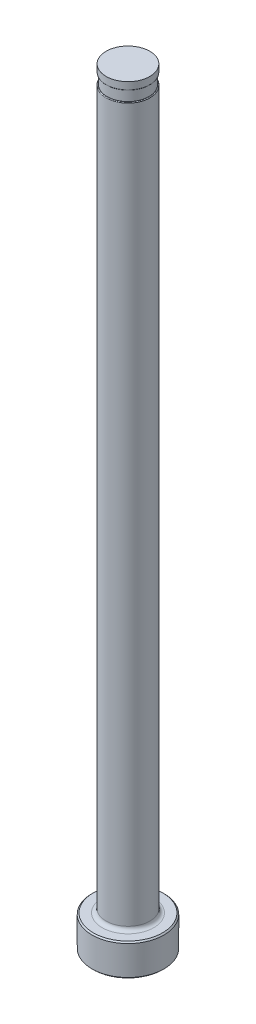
ISO-10303-21;
HEADER;
FILE_DESCRIPTION(('STEP AP214'),'2;1');
FILE_NAME('part.step','',(''),(''),'','','');
FILE_SCHEMA(('AUTOMOTIVE_DESIGN { 1 0 10303 214 1 1 1 1 }'));
ENDSEC;
DATA;
#1=APPLICATION_CONTEXT('core data for automotive mechanical design processes');
#2=APPLICATION_PROTOCOL_DEFINITION('international standard','automotive_design',2000,#1);
#3=PRODUCT_CONTEXT('',#1,'mechanical');
#4=PRODUCT('Part','Part','',(#3));
#5=PRODUCT_RELATED_PRODUCT_CATEGORY('part','',(#4));
#6=PRODUCT_DEFINITION_FORMATION('','',#4);
#7=PRODUCT_DEFINITION_CONTEXT('part definition',#1,'design');
#8=PRODUCT_DEFINITION('design','',#6,#7);
#9=PRODUCT_DEFINITION_SHAPE('','',#8);
#10=(LENGTH_UNIT() NAMED_UNIT(*) SI_UNIT(.MILLI.,.METRE.));
#11=(NAMED_UNIT(*) PLANE_ANGLE_UNIT() SI_UNIT($,.RADIAN.));
#12=(NAMED_UNIT(*) SI_UNIT($,.STERADIAN.) SOLID_ANGLE_UNIT());
#13=UNCERTAINTY_MEASURE_WITH_UNIT(LENGTH_MEASURE(1.E-05),#10,'distance_accuracy_value','');
#14=(GEOMETRIC_REPRESENTATION_CONTEXT(3) GLOBAL_UNCERTAINTY_ASSIGNED_CONTEXT((#13)) GLOBAL_UNIT_ASSIGNED_CONTEXT((#10,
#11,#12)) REPRESENTATION_CONTEXT('',''));
#15=CARTESIAN_POINT('',(0.,0.,0.));
#16=DIRECTION('',(0.,0.,1.));
#17=DIRECTION('',(1.,0.,0.));
#18=AXIS2_PLACEMENT_3D('',#15,#16,#17);
#19=CARTESIAN_POINT('',(-4.36498999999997,150.876,0.));
#20=DIRECTION('',(0.,1.,0.));
#21=DIRECTION('',(0.,0.,1.));
#22=AXIS2_PLACEMENT_3D('',#19,#20,#21);
#23=PLANE('',#22);
#24=CARTESIAN_POINT('',(0.,150.876,0.));
#25=DIRECTION('',(0.,1.,0.));
#26=DIRECTION('',(0.,0.,1.));
#27=AXIS2_PLACEMENT_3D('',#24,#25,#26);
#28=CIRCLE('',#27,4.21258999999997);
#29=CARTESIAN_POINT('',(0.,150.876,4.21258999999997));
#30=VERTEX_POINT('',#29);
#31=EDGE_CURVE('E11',#30,#30,#28,.F.);
#32=ORIENTED_EDGE('',*,*,#31,.T.);
#33=EDGE_LOOP('',(#32));
#34=FACE_BOUND('',#33,.T.);
#35=CARTESIAN_POINT('',(0.,150.876,0.));
#36=DIRECTION('',(0.,1.,0.));
#37=DIRECTION('',(0.,0.,1.));
#38=AXIS2_PLACEMENT_3D('',#35,#36,#37);
#39=CIRCLE('',#38,4.16178999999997);
#40=CARTESIAN_POINT('',(0.,150.876,4.16178999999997));
#41=VERTEX_POINT('',#40);
#42=EDGE_CURVE('E78',#41,#41,#39,.T.);
#43=ORIENTED_EDGE('',*,*,#42,.T.);
#44=EDGE_LOOP('',(#43));
#45=FACE_BOUND('',#44,.T.);
#46=ADVANCED_FACE('F36',(#34,#45),#23,.F.);
#47=CARTESIAN_POINT('',(0.,259.958771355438,0.));
#48=DIRECTION('',(0.,1.,0.));
#49=DIRECTION('',(0.,0.,1.));
#50=AXIS2_PLACEMENT_3D('',#47,#48,#49);
#51=CYLINDRICAL_SURFACE('',#50,4.36498999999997);
#52=DIRECTION('',(0.,1.,0.));
#53=VECTOR('',#52,1.);
#54=CARTESIAN_POINT('',(-4.16178999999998,259.958771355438,-1.31629848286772));
#55=LINE('',#54,#53);
#56=CARTESIAN_POINT('',(-4.16178999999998,148.717,-1.31629848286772));
#57=VERTEX_POINT('',#56);
#58=CARTESIAN_POINT('',(-4.16178999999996,86.36,-1.31629848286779));
#59=VERTEX_POINT('',#58);
#60=EDGE_CURVE('E73',#57,#59,#55,.F.);
#61=ORIENTED_EDGE('',*,*,#60,.F.);
#62=CARTESIAN_POINT('',(0.,148.717,0.));
#63=DIRECTION('',(0.,-1.,0.));
#64=DIRECTION('',(0.,0.,-1.));
#65=AXIS2_PLACEMENT_3D('',#62,#63,#64);
#66=CIRCLE('',#65,4.36498999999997);
#67=CARTESIAN_POINT('',(-4.16178999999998,148.717,1.31629848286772));
#68=VERTEX_POINT('',#67);
#69=EDGE_CURVE('E51',#57,#68,#66,.T.);
#70=ORIENTED_EDGE('',*,*,#69,.T.);
#71=DIRECTION('',(0.,1.,0.));
#72=VECTOR('',#71,1.);
#73=CARTESIAN_POINT('',(-4.16178999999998,259.958771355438,1.31629848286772));
#74=LINE('',#73,#72);
#75=CARTESIAN_POINT('',(-4.16178999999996,86.36,1.31629848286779));
#76=VERTEX_POINT('',#75);
#77=EDGE_CURVE('E84',#76,#68,#74,.T.);
#78=ORIENTED_EDGE('',*,*,#77,.F.);
#79=CARTESIAN_POINT('',(-4.16178999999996,86.36,-1.31629848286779));
#80=CARTESIAN_POINT('',(-4.16178749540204,86.3307945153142,-1.31629969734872));
#81=CARTESIAN_POINT('',(-4.1621934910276,86.3016054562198,-1.31502339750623));
#82=CARTESIAN_POINT('',(-4.16379602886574,86.2434799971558,-1.30994313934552));
#83=CARTESIAN_POINT('',(-4.16499229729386,86.2145435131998,-1.30614005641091));
#84=CARTESIAN_POINT('',(-4.16970978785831,86.1287304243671,-1.29103636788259));
#85=CARTESIAN_POINT('',(-4.1743602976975,86.0725217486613,-1.27604058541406));
#86=CARTESIAN_POINT('',(-4.18613251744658,85.9637895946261,-1.23686822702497));
#87=CARTESIAN_POINT('',(-4.19325232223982,85.9112633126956,-1.21269872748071));
#88=CARTESIAN_POINT('',(-4.2091888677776,85.8110804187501,-1.15616869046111));
#89=CARTESIAN_POINT('',(-4.21800681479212,85.7634273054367,-1.12380232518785));
#90=CARTESIAN_POINT('',(-4.23656898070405,85.6734175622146,-1.05167440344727));
#91=CARTESIAN_POINT('',(-4.24632261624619,85.6311275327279,-1.01183271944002));
#92=CARTESIAN_POINT('',(-4.26580066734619,85.5529847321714,-0.926286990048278));
#93=CARTESIAN_POINT('',(-4.27552507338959,85.5171338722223,-0.88058121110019));
#94=CARTESIAN_POINT('',(-4.29543366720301,85.447720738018,-0.778110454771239));
#95=CARTESIAN_POINT('',(-4.3055056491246,85.415104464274,-0.720683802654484));
#96=CARTESIAN_POINT('',(-4.32376922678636,85.3583921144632,-0.601498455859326));
#97=CARTESIAN_POINT('',(-4.33195978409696,85.3343007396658,-0.539737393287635));
#98=CARTESIAN_POINT('',(-4.34685789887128,85.2915798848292,-0.404062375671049));
#99=CARTESIAN_POINT('',(-4.35317398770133,85.2742625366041,-0.329691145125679));
#100=CARTESIAN_POINT('',(-4.36197215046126,85.2503864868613,-0.179011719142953));
#101=CARTESIAN_POINT('',(-4.3644520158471,85.2438339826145,-0.102702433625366));
#102=CARTESIAN_POINT('',(-4.36541803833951,85.2412580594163,0.058182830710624));
#103=CARTESIAN_POINT('',(-4.36345629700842,85.2464156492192,0.142783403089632));
#104=CARTESIAN_POINT('',(-4.35477620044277,85.2698747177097,0.309955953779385));
#105=CARTESIAN_POINT('',(-4.34805523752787,85.2881834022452,0.392526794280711));
#106=CARTESIAN_POINT('',(-4.33049146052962,85.338475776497,0.55371755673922));
#107=CARTESIAN_POINT('',(-4.31961605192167,85.3705678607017,0.632300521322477));
#108=CARTESIAN_POINT('',(-4.29509465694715,85.4487472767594,0.781669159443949));
#109=CARTESIAN_POINT('',(-4.28145345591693,85.4948105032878,0.852467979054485));
#110=CARTESIAN_POINT('',(-4.25707286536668,85.5869515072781,0.965882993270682));
#111=CARTESIAN_POINT('',(-4.24649547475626,85.6299441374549,1.01105227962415));
#112=CARTESIAN_POINT('',(-4.22598230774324,85.7230038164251,1.09362608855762));
#113=CARTESIAN_POINT('',(-4.21604624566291,85.7730676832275,1.13103408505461));
#114=CARTESIAN_POINT('',(-4.19787550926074,85.8796091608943,1.19672699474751));
#115=CARTESIAN_POINT('',(-4.18965172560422,85.9361244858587,1.22495411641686));
#116=CARTESIAN_POINT('',(-4.17605152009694,86.0536762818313,1.27055384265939));
#117=CARTESIAN_POINT('',(-4.17067066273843,86.1147055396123,1.28794336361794));
#118=CARTESIAN_POINT('',(-4.1653318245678,86.2070266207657,1.30505888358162));
#119=CARTESIAN_POINT('',(-4.16400812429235,86.2374684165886,1.30926961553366));
#120=CARTESIAN_POINT('',(-4.16223627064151,86.2986003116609,1.31488836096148));
#121=CARTESIAN_POINT('',(-4.16178714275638,86.3292900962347,1.31629949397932));
#122=CARTESIAN_POINT('',(-4.16178999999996,86.36,1.31629848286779));
#123=B_SPLINE_CURVE_WITH_KNOTS('',3,(#79,#80,#81,#82,#83,#84,#85,#86,#87,#88,#89,#90,#91,#92,
#93,#94,#95,#96,#97,#98,#99,#100,#101,#102,#103,#104,#105,#106,#107,#108,#109,#110,#111,#112,
#113,#114,#115,#116,#117,#118,#119,#120,#121,#122),.UNSPECIFIED.,.F.,.F.,(4,2,2,2,2,2,2,2,2,2,2,
2,2,2,2,2,2,2,2,2,2,4),(0.,0.0875537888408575,0.175077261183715,0.349153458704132,
0.523095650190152,0.697161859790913,0.873213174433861,1.04931665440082,1.24895267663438,
1.44869862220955,1.6776260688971,1.90668526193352,2.15985748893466,2.41316854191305,
2.66850922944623,2.92341184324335,3.11238644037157,3.30127627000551,3.49133308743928,
3.68109249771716,3.77325015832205,3.86530507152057),.UNSPECIFIED.);
#124=EDGE_CURVE('E81',#59,#76,#123,.T.);
#125=ORIENTED_EDGE('',*,*,#124,.F.);
#126=EDGE_LOOP('',(#61,#70,#78,#125));
#127=FACE_BOUND('',#126,.T.);
#128=CARTESIAN_POINT('',(0.,7.11200000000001,0.));
#129=DIRECTION('',(0.,1.,0.));
#130=DIRECTION('',(0.,0.,1.));
#131=AXIS2_PLACEMENT_3D('',#128,#129,#130);
#132=CIRCLE('',#131,4.36498999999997);
#133=CARTESIAN_POINT('',(0.,7.11200000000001,4.36498999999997));
#134=VERTEX_POINT('',#133);
#135=EDGE_CURVE('E116',#134,#134,#132,.T.);
#136=ORIENTED_EDGE('',*,*,#135,.T.);
#137=EDGE_LOOP('',(#136));
#138=FACE_BOUND('',#137,.T.);
#139=ADVANCED_FACE('F82',(#127,#138),#51,.T.);
#140=CARTESIAN_POINT('',(0.,0.,0.));
#141=DIRECTION('',(0.,-1.,0.));
#142=DIRECTION('',(0.,0.,-1.));
#143=AXIS2_PLACEMENT_3D('',#140,#141,#142);
#144=PLANE('',#143);
#145=CARTESIAN_POINT('',(0.,0.,0.));
#146=DIRECTION('',(0.,-1.,0.));
#147=DIRECTION('',(0.,0.,-1.));
#148=AXIS2_PLACEMENT_3D('',#145,#146,#147);
#149=CIRCLE('',#148,6.88339999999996);
#150=CARTESIAN_POINT('',(0.,0.,-6.88339999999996));
#151=VERTEX_POINT('',#150);
#152=EDGE_CURVE('E113',#151,#151,#149,.T.);
#153=ORIENTED_EDGE('',*,*,#152,.T.);
#154=EDGE_LOOP('',(#153));
#155=FACE_BOUND('',#154,.T.);
#156=ADVANCED_FACE('F192',(#155),#144,.T.);
#157=CARTESIAN_POINT('',(0.,259.958771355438,0.));
#158=DIRECTION('',(0.,1.,0.));
#159=DIRECTION('',(0.,0.,1.));
#160=AXIS2_PLACEMENT_3D('',#157,#158,#159);
#161=CYLINDRICAL_SURFACE('',#160,7.13739999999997);
#162=CARTESIAN_POINT('',(0.,6.09599999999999,0.));
#163=DIRECTION('',(0.,1.,0.));
#164=DIRECTION('',(0.,0.,1.));
#165=AXIS2_PLACEMENT_3D('',#162,#163,#164);
#166=CIRCLE('',#165,7.13739999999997);
#167=CARTESIAN_POINT('',(0.,6.09599999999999,7.13739999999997));
#168=VERTEX_POINT('',#167);
#169=EDGE_CURVE('E110',#168,#168,#166,.F.);
#170=ORIENTED_EDGE('',*,*,#169,.T.);
#171=EDGE_LOOP('',(#170));
#172=FACE_BOUND('',#171,.T.);
#173=CARTESIAN_POINT('',(0.,0.254000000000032,0.));
#174=DIRECTION('',(0.,-1.,0.));
#175=DIRECTION('',(0.,0.,-1.));
#176=AXIS2_PLACEMENT_3D('',#173,#174,#175);
#177=CIRCLE('',#176,7.13739999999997);
#178=CARTESIAN_POINT('',(0.,0.254000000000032,-7.13739999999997));
#179=VERTEX_POINT('',#178);
#180=EDGE_CURVE('E107',#179,#179,#177,.F.);
#181=ORIENTED_EDGE('',*,*,#180,.T.);
#182=EDGE_LOOP('',(#181));
#183=FACE_BOUND('',#182,.T.);
#184=ADVANCED_FACE('F195',(#172,#183),#161,.T.);
#185=CARTESIAN_POINT('',(-7.13739999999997,6.35,0.));
#186=DIRECTION('',(0.,1.,0.));
#187=DIRECTION('',(0.,0.,1.));
#188=AXIS2_PLACEMENT_3D('',#185,#186,#187);
#189=PLANE('',#188);
#190=CARTESIAN_POINT('',(0.,6.35,0.));
#191=DIRECTION('',(0.,1.,0.));
#192=DIRECTION('',(0.,0.,1.));
#193=AXIS2_PLACEMENT_3D('',#190,#191,#192);
#194=CIRCLE('',#193,5.12698999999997);
#195=CARTESIAN_POINT('',(0.,6.35,5.12698999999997));
#196=VERTEX_POINT('',#195);
#197=EDGE_CURVE('E87',#196,#196,#194,.F.);
#198=ORIENTED_EDGE('',*,*,#197,.T.);
#199=EDGE_LOOP('',(#198));
#200=FACE_BOUND('',#199,.T.);
#201=CARTESIAN_POINT('',(0.,6.35,0.));
#202=DIRECTION('',(0.,1.,0.));
#203=DIRECTION('',(0.,0.,1.));
#204=AXIS2_PLACEMENT_3D('',#201,#202,#203);
#205=CIRCLE('',#204,6.88340000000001);
#206=CARTESIAN_POINT('',(0.,6.35,6.88340000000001));
#207=VERTEX_POINT('',#206);
#208=EDGE_CURVE('E104',#207,#207,#205,.T.);
#209=ORIENTED_EDGE('',*,*,#208,.T.);
#210=EDGE_LOOP('',(#209));
#211=FACE_BOUND('',#210,.T.);
#212=ADVANCED_FACE('F190',(#200,#211),#189,.T.);
#213=CARTESIAN_POINT('',(0.,6.35000000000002,0.));
#214=DIRECTION('',(0.,-1.,0.));
#215=DIRECTION('',(0.,0.,-1.));
#216=AXIS2_PLACEMENT_3D('',#213,#214,#215);
#217=CONICAL_SURFACE('',#216,6.88339999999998,0.785398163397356);
#218=ORIENTED_EDGE('',*,*,#169,.F.);
#219=EDGE_LOOP('',(#218));
#220=FACE_BOUND('',#219,.T.);
#221=ORIENTED_EDGE('',*,*,#208,.F.);
#222=EDGE_LOOP('',(#221));
#223=FACE_BOUND('',#222,.T.);
#224=ADVANCED_FACE('F186',(#220,#223),#217,.T.);
#225=CARTESIAN_POINT('',(0.,0.254000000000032,0.));
#226=DIRECTION('',(0.,1.,0.));
#227=DIRECTION('',(0.,0.,1.));
#228=AXIS2_PLACEMENT_3D('',#225,#226,#227);
#229=CONICAL_SURFACE('',#228,7.13739999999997,0.785398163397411);
#230=ORIENTED_EDGE('',*,*,#152,.F.);
#231=EDGE_LOOP('',(#230));
#232=FACE_BOUND('',#231,.T.);
#233=ORIENTED_EDGE('',*,*,#180,.F.);
#234=EDGE_LOOP('',(#233));
#235=FACE_BOUND('',#234,.T.);
#236=ADVANCED_FACE('F182',(#232,#235),#229,.T.);
#237=CARTESIAN_POINT('',(0.,7.11200000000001,0.));
#238=DIRECTION('',(0.,1.,0.));
#239=DIRECTION('',(0.,0.,1.));
#240=AXIS2_PLACEMENT_3D('',#237,#238,#239);
#241=TOROIDAL_SURFACE('',#240,5.12698999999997,0.762);
#242=ORIENTED_EDGE('',*,*,#197,.F.);
#243=EDGE_LOOP('',(#242));
#244=FACE_BOUND('',#243,.T.);
#245=ORIENTED_EDGE('',*,*,#135,.F.);
#246=EDGE_LOOP('',(#245));
#247=FACE_BOUND('',#246,.T.);
#248=ADVANCED_FACE('F147',(#244,#247),#241,.F.);
#249=CARTESIAN_POINT('',(-4.36498999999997,148.844,0.));
#250=DIRECTION('',(0.,-1.,0.));
#251=DIRECTION('',(0.,0.,-1.));
#252=AXIS2_PLACEMENT_3D('',#249,#250,#251);
#253=PLANE('',#252);
#254=DIRECTION('',(0.,0.,1.));
#255=VECTOR('',#254,1.);
#256=CARTESIAN_POINT('',(-4.16178999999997,148.844,0.));
#257=LINE('',#256,#255);
#258=CARTESIAN_POINT('',(-4.16178999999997,148.844,0.));
#259=VERTEX_POINT('',#258);
#260=CARTESIAN_POINT('',(-4.16178999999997,148.844,0.800039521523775));
#261=VERTEX_POINT('',#260);
#262=EDGE_CURVE('E90',#259,#261,#257,.T.);
#263=ORIENTED_EDGE('',*,*,#262,.T.);
#264=CARTESIAN_POINT('',(0.,148.844,0.));
#265=DIRECTION('',(0.,-1.,0.));
#266=DIRECTION('',(0.,0.,-1.));
#267=AXIS2_PLACEMENT_3D('',#264,#265,#266);
#268=CIRCLE('',#267,4.23798999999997);
#269=CARTESIAN_POINT('',(-4.16178999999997,148.844,-0.800039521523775));
#270=VERTEX_POINT('',#269);
#271=EDGE_CURVE('E86',#261,#270,#268,.F.);
#272=ORIENTED_EDGE('',*,*,#271,.T.);
#273=EDGE_CURVE('E79',#270,#259,#257,.T.);
#274=ORIENTED_EDGE('',*,*,#273,.T.);
#275=CARTESIAN_POINT('',(0.,148.844,0.));
#276=DIRECTION('',(0.,1.,0.));
#277=DIRECTION('',(0.,0.,1.));
#278=AXIS2_PLACEMENT_3D('',#275,#276,#277);
#279=CIRCLE('',#278,4.16178999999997);
#280=EDGE_CURVE('E101',#259,#259,#279,.T.);
#281=ORIENTED_EDGE('',*,*,#280,.F.);
#282=EDGE_LOOP('',(#263,#272,#274,#281));
#283=FACE_BOUND('',#282,.T.);
#284=ADVANCED_FACE('F144',(#283),#253,.F.);
#285=CARTESIAN_POINT('',(0.,153.448281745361,0.));
#286=DIRECTION('',(0.,1.,0.));
#287=DIRECTION('',(0.,0.,1.));
#288=AXIS2_PLACEMENT_3D('',#285,#286,#287);
#289=CYLINDRICAL_SURFACE('',#288,4.16178999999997);
#290=ORIENTED_EDGE('',*,*,#42,.F.);
#291=EDGE_LOOP('',(#290));
#292=FACE_BOUND('',#291,.T.);
#293=ORIENTED_EDGE('',*,*,#280,.T.);
#294=EDGE_LOOP('',(#293));
#295=FACE_BOUND('',#294,.T.);
#296=ADVANCED_FACE('F141',(#292,#295),#289,.T.);
#297=CARTESIAN_POINT('',(-4.16178999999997,149.86,-7.13739999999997));
#298=DIRECTION('',(1.,0.,0.));
#299=DIRECTION('',(0.,1.,0.));
#300=AXIS2_PLACEMENT_3D('',#297,#298,#299);
#301=PLANE('',#300);
#302=ORIENTED_EDGE('',*,*,#273,.F.);
#303=CARTESIAN_POINT('',(-4.16178999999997,148.844,-0.800039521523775));
#304=CARTESIAN_POINT('',(-4.16178999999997,148.843995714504,-0.82118028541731));
#305=CARTESIAN_POINT('',(-4.16178999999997,148.843811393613,-0.842323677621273));
#306=CARTESIAN_POINT('',(-4.16178999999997,148.842968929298,-0.884617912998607));
#307=CARTESIAN_POINT('',(-4.16178999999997,148.842310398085,-0.90576874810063));
#308=CARTESIAN_POINT('',(-4.16178999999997,148.84040080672,-0.94814725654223));
#309=CARTESIAN_POINT('',(-4.16178999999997,148.83914690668,-0.969374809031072));
#310=CARTESIAN_POINT('',(-4.16178999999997,148.835884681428,-1.01176701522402));
#311=CARTESIAN_POINT('',(-4.16178999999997,148.83387661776,-1.03293168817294));
#312=CARTESIAN_POINT('',(-4.16178999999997,148.829582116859,-1.0691753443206));
#313=CARTESIAN_POINT('',(-4.16178999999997,148.827535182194,-1.08428194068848));
#314=CARTESIAN_POINT('',(-4.16178999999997,148.82280524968,-1.11437533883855));
#315=CARTESIAN_POINT('',(-4.16178999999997,148.820123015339,-1.12936226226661));
#316=CARTESIAN_POINT('',(-4.16178999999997,148.81271784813,-1.1651316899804));
#317=CARTESIAN_POINT('',(-4.16178999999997,148.807607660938,-1.18584256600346));
#318=CARTESIAN_POINT('',(-4.16178999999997,148.797913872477,-1.21666683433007));
#319=CARTESIAN_POINT('',(-4.16178999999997,148.794267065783,-1.22706935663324));
#320=CARTESIAN_POINT('',(-4.16178999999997,148.786021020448,-1.24746733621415));
#321=CARTESIAN_POINT('',(-4.16178999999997,148.781424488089,-1.25746385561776));
#322=CARTESIAN_POINT('',(-4.16178999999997,148.771697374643,-1.27503085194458));
#323=CARTESIAN_POINT('',(-4.16178999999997,148.766799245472,-1.28272062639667));
#324=CARTESIAN_POINT('',(-4.16178999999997,148.758266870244,-1.29339494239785));
#325=CARTESIAN_POINT('',(-4.16178999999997,148.755203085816,-1.29682769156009));
#326=CARTESIAN_POINT('',(-4.16178999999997,148.748576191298,-1.3031775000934));
#327=CARTESIAN_POINT('',(-4.16178999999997,148.745014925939,-1.30609637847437));
#328=CARTESIAN_POINT('',(-4.16178999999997,148.739046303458,-1.30995281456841));
#329=CARTESIAN_POINT('',(-4.16178999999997,148.736835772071,-1.31119247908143));
#330=CARTESIAN_POINT('',(-4.16178999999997,148.732254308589,-1.31331673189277));
#331=CARTESIAN_POINT('',(-4.16178999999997,148.729883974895,-1.31420256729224));
#332=CARTESIAN_POINT('',(-4.16178999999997,148.725757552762,-1.31533351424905));
#333=CARTESIAN_POINT('',(-4.16178999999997,148.724032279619,-1.31569134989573));
#334=CARTESIAN_POINT('',(-4.16178999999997,148.72053901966,-1.31617571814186));
#335=CARTESIAN_POINT('',(-4.16178999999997,148.718770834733,-1.31630080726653));
#336=CARTESIAN_POINT('',(-4.16178999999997,148.717000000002,-1.31629848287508));
#337=B_SPLINE_CURVE_WITH_KNOTS('',3,(#303,#304,#305,#306,#307,#308,#309,#310,#311,#312,#313,
#314,#315,#316,#317,#318,#319,#320,#321,#322,#323,#324,#325,#326,#327,#328,#329,#330,#331,#332,
#333,#334,#335,#336),.UNSPECIFIED.,.F.,.F.,(4,2,2,2,2,2,2,2,2,2,2,2,2,2,2,2,4),(0.,
0.0634255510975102,0.126903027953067,0.1906863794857,0.25444763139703,0.300168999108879,
0.345835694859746,0.409709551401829,0.442747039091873,0.475691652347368,0.50289830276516,
0.516668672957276,0.530389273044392,0.537969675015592,0.545523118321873,0.550794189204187,
0.556097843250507),.UNSPECIFIED.);
#338=EDGE_CURVE('E59',#270,#57,#337,.T.);
#339=ORIENTED_EDGE('',*,*,#338,.T.);
#340=ORIENTED_EDGE('',*,*,#60,.T.);
#341=DIRECTION('',(0.,0.,1.));
#342=VECTOR('',#341,1.);
#343=CARTESIAN_POINT('',(-4.16178999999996,86.36,-7.13739999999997));
#344=LINE('',#343,#342);
#345=EDGE_CURVE('E77',#59,#76,#344,.T.);
#346=ORIENTED_EDGE('',*,*,#345,.T.);
#347=ORIENTED_EDGE('',*,*,#77,.T.);
#348=CARTESIAN_POINT('',(-4.16178999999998,148.717,1.31629848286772));
#349=CARTESIAN_POINT('',(-4.16178999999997,148.719523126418,1.31630667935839));
#350=CARTESIAN_POINT('',(-4.16178999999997,148.722034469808,1.31604955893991));
#351=CARTESIAN_POINT('',(-4.16178999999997,148.726933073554,1.31508340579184));
#352=CARTESIAN_POINT('',(-4.16178999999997,148.729321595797,1.31438089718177));
#353=CARTESIAN_POINT('',(-4.16178999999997,148.734507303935,1.3123841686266));
#354=CARTESIAN_POINT('',(-4.16178999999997,148.737264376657,1.31098819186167));
#355=CARTESIAN_POINT('',(-4.16178999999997,148.742531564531,1.30777210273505));
#356=CARTESIAN_POINT('',(-4.16178999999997,148.745040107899,1.30594950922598));
#357=CARTESIAN_POINT('',(-4.16178999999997,148.75152418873,1.30060082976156));
#358=CARTESIAN_POINT('',(-4.16178999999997,148.755261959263,1.2967903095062));
#359=CARTESIAN_POINT('',(-4.16178999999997,148.762164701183,1.28869316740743));
#360=CARTESIAN_POINT('',(-4.16178999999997,148.765328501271,1.28440560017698));
#361=CARTESIAN_POINT('',(-4.16178999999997,148.776792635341,1.2672315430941));
#362=CARTESIAN_POINT('',(-4.16178999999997,148.783556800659,1.25334498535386));
#363=CARTESIAN_POINT('',(-4.16178999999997,148.795249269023,1.22482528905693));
#364=CARTESIAN_POINT('',(-4.16178999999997,148.800164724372,1.21018770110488));
#365=CARTESIAN_POINT('',(-4.16178999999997,148.812246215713,1.16868418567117));
#366=CARTESIAN_POINT('',(-4.16178999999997,148.818057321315,1.14142260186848));
#367=CARTESIAN_POINT('',(-4.16178999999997,148.827470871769,1.08650877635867));
#368=CARTESIAN_POINT('',(-4.16178999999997,148.831067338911,1.05885568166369));
#369=CARTESIAN_POINT('',(-4.16178999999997,148.836732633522,1.00338718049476));
#370=CARTESIAN_POINT('',(-4.16178999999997,148.838801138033,0.975571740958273));
#371=CARTESIAN_POINT('',(-4.16178999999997,148.841839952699,0.919916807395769));
#372=CARTESIAN_POINT('',(-4.16178999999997,148.842811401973,0.892077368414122));
#373=CARTESIAN_POINT('',(-4.16178999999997,148.843591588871,0.853520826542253));
#374=CARTESIAN_POINT('',(-4.16178999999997,148.843747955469,0.842809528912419));
#375=CARTESIAN_POINT('',(-4.16178999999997,148.843951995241,0.821412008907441));
#376=CARTESIAN_POINT('',(-4.16178999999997,148.843999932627,0.810725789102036));
#377=CARTESIAN_POINT('',(-4.16178999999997,148.844,0.800039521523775));
#378=B_SPLINE_CURVE_WITH_KNOTS('',3,(#348,#349,#350,#351,#352,#353,#354,#355,#356,#357,#358,
#359,#360,#361,#362,#363,#364,#365,#366,#367,#368,#369,#370,#371,#372,#373,#374,#375,#376,#377),
.UNSPECIFIED.,.F.,.F.,(4,2,2,2,2,2,2,2,2,2,2,2,2,2,4),(0.,0.00753740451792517,
0.0149668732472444,0.0241855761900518,0.0334592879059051,0.0493821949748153,0.0653372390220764,
0.11131304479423,0.157602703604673,0.241002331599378,0.324626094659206,0.408267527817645,
0.491822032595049,0.52395895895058,0.55601749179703),.UNSPECIFIED.);
#379=EDGE_CURVE('E172',#68,#261,#378,.T.);
#380=ORIENTED_EDGE('',*,*,#379,.T.);
#381=ORIENTED_EDGE('',*,*,#262,.F.);
#382=EDGE_LOOP('',(#302,#339,#340,#346,#347,#380,#381));
#383=FACE_BOUND('',#382,.T.);
#384=ADVANCED_FACE('F75',(#383),#301,.F.);
#385=CARTESIAN_POINT('',(-7.33678999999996,86.36,-7.13739999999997));
#386=DIRECTION('',(0.,0.,1.));
#387=DIRECTION('',(1.,0.,0.));
#388=AXIS2_PLACEMENT_3D('',#385,#386,#387);
#389=CYLINDRICAL_SURFACE('',#388,3.175);
#390=ORIENTED_EDGE('',*,*,#345,.F.);
#391=ORIENTED_EDGE('',*,*,#124,.T.);
#392=EDGE_LOOP('',(#390,#391));
#393=FACE_BOUND('',#392,.T.);
#394=ADVANCED_FACE('F89',(#393),#389,.F.);
#395=CARTESIAN_POINT('',(0.,152.687735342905,0.));
#396=DIRECTION('',(0.,1.,0.));
#397=DIRECTION('',(0.,0.,1.));
#398=AXIS2_PLACEMENT_3D('',#395,#396,#397);
#399=CYLINDRICAL_SURFACE('',#398,4.33958999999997);
#400=CARTESIAN_POINT('',(0.,151.003,0.));
#401=DIRECTION('',(0.,1.,0.));
#402=DIRECTION('',(0.,0.,1.));
#403=AXIS2_PLACEMENT_3D('',#400,#401,#402);
#404=CIRCLE('',#403,4.33958999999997);
#405=CARTESIAN_POINT('',(0.,151.003,4.33958999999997));
#406=VERTEX_POINT('',#405);
#407=EDGE_CURVE('E44',#406,#406,#404,.T.);
#408=ORIENTED_EDGE('',*,*,#407,.T.);
#409=EDGE_LOOP('',(#408));
#410=FACE_BOUND('',#409,.T.);
#411=CARTESIAN_POINT('',(0.,152.4,0.));
#412=DIRECTION('',(0.,1.,0.));
#413=DIRECTION('',(0.,0.,1.));
#414=AXIS2_PLACEMENT_3D('',#411,#412,#413);
#415=CIRCLE('',#414,4.33958999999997);
#416=CARTESIAN_POINT('',(0.,152.4,4.33958999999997));
#417=VERTEX_POINT('',#416);
#418=EDGE_CURVE('E91',#417,#417,#415,.T.);
#419=ORIENTED_EDGE('',*,*,#418,.F.);
#420=EDGE_LOOP('',(#419));
#421=FACE_BOUND('',#420,.T.);
#422=ADVANCED_FACE('F135',(#410,#421),#399,.T.);
#423=CARTESIAN_POINT('',(-4.36498999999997,152.4,0.));
#424=DIRECTION('',(0.,1.,0.));
#425=DIRECTION('',(0.,0.,1.));
#426=AXIS2_PLACEMENT_3D('',#423,#424,#425);
#427=PLANE('',#426);
#428=ORIENTED_EDGE('',*,*,#418,.T.);
#429=EDGE_LOOP('',(#428));
#430=FACE_BOUND('',#429,.T.);
#431=ADVANCED_FACE('F149',(#430),#427,.T.);
#432=CARTESIAN_POINT('',(0.,148.717,0.));
#433=DIRECTION('',(0.,-1.,0.));
#434=DIRECTION('',(0.,0.,-1.));
#435=AXIS2_PLACEMENT_3D('',#432,#433,#434);
#436=TOROIDAL_SURFACE('',#435,4.23798999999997,0.127);
#437=ORIENTED_EDGE('',*,*,#379,.F.);
#438=ORIENTED_EDGE('',*,*,#69,.F.);
#439=ORIENTED_EDGE('',*,*,#338,.F.);
#440=ORIENTED_EDGE('',*,*,#271,.F.);
#441=EDGE_LOOP('',(#437,#438,#439,#440));
#442=FACE_BOUND('',#441,.T.);
#443=ADVANCED_FACE('F151',(#442),#436,.T.);
#444=CARTESIAN_POINT('',(0.,151.003,0.));
#445=DIRECTION('',(0.,1.,0.));
#446=DIRECTION('',(0.,0.,1.));
#447=AXIS2_PLACEMENT_3D('',#444,#445,#446);
#448=TOROIDAL_SURFACE('',#447,4.21258999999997,0.127);
#449=ORIENTED_EDGE('',*,*,#31,.F.);
#450=EDGE_LOOP('',(#449));
#451=FACE_BOUND('',#450,.T.);
#452=ORIENTED_EDGE('',*,*,#407,.F.);
#453=EDGE_LOOP('',(#452));
#454=FACE_BOUND('',#453,.T.);
#455=ADVANCED_FACE('F38',(#451,#454),#448,.T.);
#456=CLOSED_SHELL('',(#46,#139,#156,#184,#212,#224,#236,#248,#284,#296,#384,#394,#422,#431,#443,#455));
#457=MANIFOLD_SOLID_BREP('B2',#456);
#458=ADVANCED_BREP_SHAPE_REPRESENTATION('',(#18,#457),#14);
#459=SHAPE_DEFINITION_REPRESENTATION(#9,#458);
ENDSEC;
END-ISO-10303-21;
